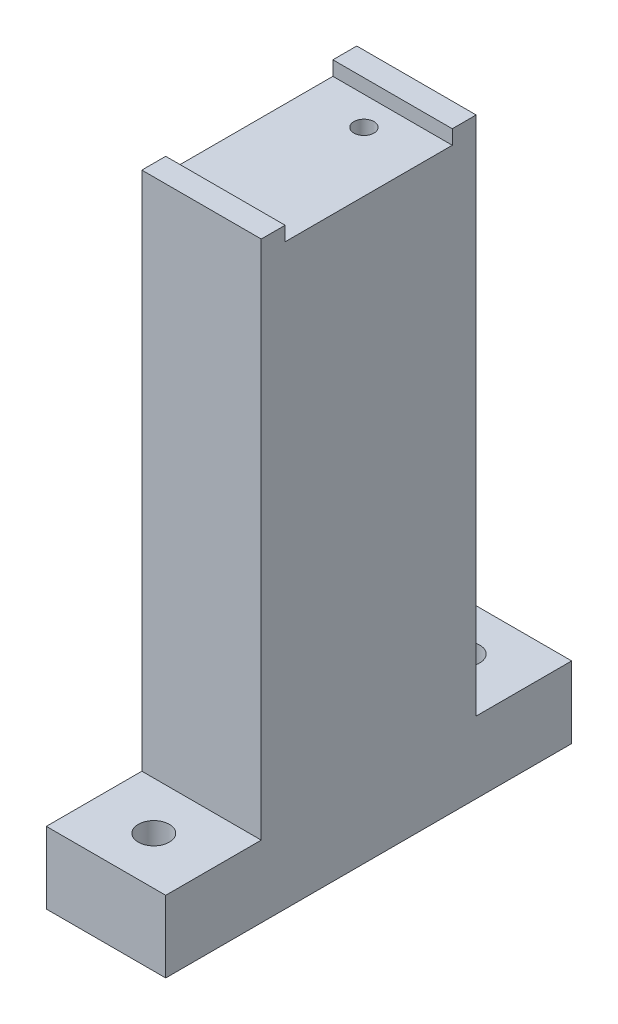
ISO-10303-21;
HEADER;
FILE_DESCRIPTION(('STEP AP214'),'2;1');
FILE_NAME('part.step','',(''),(''),'','','');
FILE_SCHEMA(('AUTOMOTIVE_DESIGN { 1 0 10303 214 1 1 1 1 }'));
ENDSEC;
DATA;
#1=APPLICATION_CONTEXT('core data for automotive mechanical design processes');
#2=APPLICATION_PROTOCOL_DEFINITION('international standard','automotive_design',2000,#1);
#3=PRODUCT_CONTEXT('',#1,'mechanical');
#4=PRODUCT('Part','Part','',(#3));
#5=PRODUCT_RELATED_PRODUCT_CATEGORY('part','',(#4));
#6=PRODUCT_DEFINITION_FORMATION('','',#4);
#7=PRODUCT_DEFINITION_CONTEXT('part definition',#1,'design');
#8=PRODUCT_DEFINITION('design','',#6,#7);
#9=PRODUCT_DEFINITION_SHAPE('','',#8);
#10=(LENGTH_UNIT() NAMED_UNIT(*) SI_UNIT(.MILLI.,.METRE.));
#11=(NAMED_UNIT(*) PLANE_ANGLE_UNIT() SI_UNIT($,.RADIAN.));
#12=(NAMED_UNIT(*) SI_UNIT($,.STERADIAN.) SOLID_ANGLE_UNIT());
#13=UNCERTAINTY_MEASURE_WITH_UNIT(LENGTH_MEASURE(1.E-05),#10,'distance_accuracy_value','');
#14=(GEOMETRIC_REPRESENTATION_CONTEXT(3) GLOBAL_UNCERTAINTY_ASSIGNED_CONTEXT((#13)) GLOBAL_UNIT_ASSIGNED_CONTEXT((#10,
#11,#12)) REPRESENTATION_CONTEXT('',''));
#15=CARTESIAN_POINT('',(0.,0.,0.));
#16=DIRECTION('',(0.,0.,1.));
#17=DIRECTION('',(1.,0.,0.));
#18=AXIS2_PLACEMENT_3D('',#15,#16,#17);
#19=CARTESIAN_POINT('',(25.,0.,85.));
#20=DIRECTION('',(-1.,0.,0.));
#21=DIRECTION('',(0.,0.,1.));
#22=AXIS2_PLACEMENT_3D('',#19,#20,#21);
#23=PLANE('',#22);
#24=DIRECTION('',(0.,1.,0.));
#25=VECTOR('',#24,1.);
#26=CARTESIAN_POINT('',(25.,121.,60.));
#27=LINE('',#26,#25);
#28=CARTESIAN_POINT('',(25.,121.,60.));
#29=VERTEX_POINT('',#28);
#30=CARTESIAN_POINT('',(25.,124.,60.));
#31=VERTEX_POINT('',#30);
#32=EDGE_CURVE('E134',#29,#31,#27,.T.);
#33=ORIENTED_EDGE('',*,*,#32,.T.);
#34=DIRECTION('',(0.,0.,-1.));
#35=VECTOR('',#34,1.);
#36=CARTESIAN_POINT('',(25.,124.,85.));
#37=LINE('',#36,#35);
#38=CARTESIAN_POINT('',(25.,124.,65.));
#39=VERTEX_POINT('',#38);
#40=EDGE_CURVE('E141',#39,#31,#37,.T.);
#41=ORIENTED_EDGE('',*,*,#40,.F.);
#42=DIRECTION('',(0.,-1.,0.));
#43=VECTOR('',#42,1.);
#44=CARTESIAN_POINT('',(25.,15.,65.));
#45=LINE('',#44,#43);
#46=CARTESIAN_POINT('',(25.,15.,65.));
#47=VERTEX_POINT('',#46);
#48=EDGE_CURVE('E123',#39,#47,#45,.T.);
#49=ORIENTED_EDGE('',*,*,#48,.T.);
#50=DIRECTION('',(0.,0.,1.));
#51=VECTOR('',#50,1.);
#52=CARTESIAN_POINT('',(25.,15.,85.));
#53=LINE('',#52,#51);
#54=CARTESIAN_POINT('',(25.,15.,85.));
#55=VERTEX_POINT('',#54);
#56=EDGE_CURVE('E133',#47,#55,#53,.T.);
#57=ORIENTED_EDGE('',*,*,#56,.T.);
#58=DIRECTION('',(0.,1.,0.));
#59=VECTOR('',#58,1.);
#60=CARTESIAN_POINT('',(25.,0.,85.));
#61=LINE('',#60,#59);
#62=CARTESIAN_POINT('',(25.,0.,85.));
#63=VERTEX_POINT('',#62);
#64=EDGE_CURVE('E214',#63,#55,#61,.T.);
#65=ORIENTED_EDGE('',*,*,#64,.F.);
#66=DIRECTION('',(0.,0.,-1.));
#67=VECTOR('',#66,1.);
#68=CARTESIAN_POINT('',(25.,0.,85.));
#69=LINE('',#68,#67);
#70=CARTESIAN_POINT('',(25.,0.,0.));
#71=VERTEX_POINT('',#70);
#72=EDGE_CURVE('E149',#63,#71,#69,.T.);
#73=ORIENTED_EDGE('',*,*,#72,.T.);
#74=DIRECTION('',(0.,1.,0.));
#75=VECTOR('',#74,1.);
#76=CARTESIAN_POINT('',(25.,0.,0.));
#77=LINE('',#76,#75);
#78=CARTESIAN_POINT('',(25.,14.9999999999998,0.));
#79=VERTEX_POINT('',#78);
#80=EDGE_CURVE('E223',#71,#79,#77,.T.);
#81=ORIENTED_EDGE('',*,*,#80,.T.);
#82=DIRECTION('',(0.,0.,1.));
#83=VECTOR('',#82,1.);
#84=CARTESIAN_POINT('',(25.,14.9999999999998,20.));
#85=LINE('',#84,#83);
#86=CARTESIAN_POINT('',(25.,14.9999999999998,20.));
#87=VERTEX_POINT('',#86);
#88=EDGE_CURVE('E185',#79,#87,#85,.T.);
#89=ORIENTED_EDGE('',*,*,#88,.T.);
#90=DIRECTION('',(0.,1.,0.));
#91=VECTOR('',#90,1.);
#92=CARTESIAN_POINT('',(25.,14.9999999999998,20.));
#93=LINE('',#92,#91);
#94=CARTESIAN_POINT('',(25.,124.,20.));
#95=VERTEX_POINT('',#94);
#96=EDGE_CURVE('E188',#87,#95,#93,.T.);
#97=ORIENTED_EDGE('',*,*,#96,.T.);
#98=CARTESIAN_POINT('',(25.,124.,25.));
#99=VERTEX_POINT('',#98);
#100=EDGE_CURVE('E150',#99,#95,#37,.T.);
#101=ORIENTED_EDGE('',*,*,#100,.F.);
#102=DIRECTION('',(0.,-1.,0.));
#103=VECTOR('',#102,1.);
#104=CARTESIAN_POINT('',(25.,121.,25.));
#105=LINE('',#104,#103);
#106=CARTESIAN_POINT('',(25.,121.,25.));
#107=VERTEX_POINT('',#106);
#108=EDGE_CURVE('E191',#99,#107,#105,.T.);
#109=ORIENTED_EDGE('',*,*,#108,.T.);
#110=DIRECTION('',(0.,0.,1.));
#111=VECTOR('',#110,1.);
#112=CARTESIAN_POINT('',(25.,121.,60.));
#113=LINE('',#112,#111);
#114=EDGE_CURVE('E194',#107,#29,#113,.T.);
#115=ORIENTED_EDGE('',*,*,#114,.T.);
#116=EDGE_LOOP('',(#33,#41,#49,#57,#65,#73,#81,#89,#97,#101,#109,#115));
#117=FACE_BOUND('',#116,.T.);
#118=ADVANCED_FACE('F33',(#117),#23,.F.);
#119=CARTESIAN_POINT('',(0.,124.,85.));
#120=DIRECTION('',(0.,-1.,0.));
#121=DIRECTION('',(0.,0.,-1.));
#122=AXIS2_PLACEMENT_3D('',#119,#120,#121);
#123=PLANE('',#122);
#124=DIRECTION('',(1.,0.,0.));
#125=VECTOR('',#124,1.);
#126=CARTESIAN_POINT('',(-60.,124.,60.));
#127=LINE('',#126,#125);
#128=CARTESIAN_POINT('',(0.,124.,60.));
#129=VERTEX_POINT('',#128);
#130=EDGE_CURVE('E144',#129,#31,#127,.T.);
#131=ORIENTED_EDGE('',*,*,#130,.F.);
#132=DIRECTION('',(0.,0.,-1.));
#133=VECTOR('',#132,1.);
#134=CARTESIAN_POINT('',(0.,124.,85.));
#135=LINE('',#134,#133);
#136=CARTESIAN_POINT('',(0.,124.,65.));
#137=VERTEX_POINT('',#136);
#138=EDGE_CURVE('E143',#137,#129,#135,.T.);
#139=ORIENTED_EDGE('',*,*,#138,.F.);
#140=DIRECTION('',(1.,0.,0.));
#141=VECTOR('',#140,1.);
#142=CARTESIAN_POINT('',(-60.,124.,65.));
#143=LINE('',#142,#141);
#144=EDGE_CURVE('E126',#137,#39,#143,.T.);
#145=ORIENTED_EDGE('',*,*,#144,.T.);
#146=ORIENTED_EDGE('',*,*,#40,.T.);
#147=EDGE_LOOP('',(#131,#139,#145,#146));
#148=FACE_BOUND('',#147,.T.);
#149=ADVANCED_FACE('F140',(#148),#123,.F.);
#150=DIRECTION('',(1.,0.,0.));
#151=VECTOR('',#150,1.);
#152=CARTESIAN_POINT('',(-60.,124.,25.));
#153=LINE('',#152,#151);
#154=CARTESIAN_POINT('',(0.,124.,25.));
#155=VERTEX_POINT('',#154);
#156=EDGE_CURVE('E50',#155,#99,#153,.T.);
#157=ORIENTED_EDGE('',*,*,#156,.T.);
#158=ORIENTED_EDGE('',*,*,#100,.T.);
#159=DIRECTION('',(1.,0.,0.));
#160=VECTOR('',#159,1.);
#161=CARTESIAN_POINT('',(-60.,124.,20.));
#162=LINE('',#161,#160);
#163=CARTESIAN_POINT('',(0.,124.,20.));
#164=VERTEX_POINT('',#163);
#165=EDGE_CURVE('E202',#164,#95,#162,.T.);
#166=ORIENTED_EDGE('',*,*,#165,.F.);
#167=EDGE_CURVE('E157',#155,#164,#135,.T.);
#168=ORIENTED_EDGE('',*,*,#167,.F.);
#169=EDGE_LOOP('',(#157,#158,#166,#168));
#170=FACE_BOUND('',#169,.T.);
#171=ADVANCED_FACE('F256',(#170),#123,.F.);
#172=CARTESIAN_POINT('',(0.,0.,85.));
#173=DIRECTION('',(1.,0.,0.));
#174=DIRECTION('',(0.,0.,-1.));
#175=AXIS2_PLACEMENT_3D('',#172,#173,#174);
#176=PLANE('',#175);
#177=DIRECTION('',(0.,1.,0.));
#178=VECTOR('',#177,1.);
#179=CARTESIAN_POINT('',(0.,0.,60.));
#180=LINE('',#179,#178);
#181=CARTESIAN_POINT('',(0.,121.,60.));
#182=VERTEX_POINT('',#181);
#183=EDGE_CURVE('E12',#182,#129,#180,.T.);
#184=ORIENTED_EDGE('',*,*,#183,.F.);
#185=DIRECTION('',(0.,0.,1.));
#186=VECTOR('',#185,1.);
#187=CARTESIAN_POINT('',(0.,121.,85.));
#188=LINE('',#187,#186);
#189=CARTESIAN_POINT('',(0.,121.,25.));
#190=VERTEX_POINT('',#189);
#191=EDGE_CURVE('E42',#190,#182,#188,.T.);
#192=ORIENTED_EDGE('',*,*,#191,.F.);
#193=DIRECTION('',(0.,-1.,0.));
#194=VECTOR('',#193,1.);
#195=CARTESIAN_POINT('',(0.,0.,25.));
#196=LINE('',#195,#194);
#197=EDGE_CURVE('E167',#155,#190,#196,.T.);
#198=ORIENTED_EDGE('',*,*,#197,.F.);
#199=ORIENTED_EDGE('',*,*,#167,.T.);
#200=DIRECTION('',(0.,1.,0.));
#201=VECTOR('',#200,1.);
#202=CARTESIAN_POINT('',(0.,0.,20.));
#203=LINE('',#202,#201);
#204=CARTESIAN_POINT('',(0.,14.9999999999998,20.));
#205=VERTEX_POINT('',#204);
#206=EDGE_CURVE('E165',#205,#164,#203,.T.);
#207=ORIENTED_EDGE('',*,*,#206,.F.);
#208=DIRECTION('',(0.,0.,1.));
#209=VECTOR('',#208,1.);
#210=CARTESIAN_POINT('',(0.,14.9999999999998,85.));
#211=LINE('',#210,#209);
#212=CARTESIAN_POINT('',(0.,14.9999999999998,0.));
#213=VERTEX_POINT('',#212);
#214=EDGE_CURVE('E198',#213,#205,#211,.T.);
#215=ORIENTED_EDGE('',*,*,#214,.F.);
#216=DIRECTION('',(0.,-1.,0.));
#217=VECTOR('',#216,1.);
#218=CARTESIAN_POINT('',(0.,0.,0.));
#219=LINE('',#218,#217);
#220=CARTESIAN_POINT('',(0.,0.,0.));
#221=VERTEX_POINT('',#220);
#222=EDGE_CURVE('E215',#213,#221,#219,.T.);
#223=ORIENTED_EDGE('',*,*,#222,.T.);
#224=DIRECTION('',(0.,0.,-1.));
#225=VECTOR('',#224,1.);
#226=CARTESIAN_POINT('',(0.,0.,85.));
#227=LINE('',#226,#225);
#228=CARTESIAN_POINT('',(0.,0.,85.));
#229=VERTEX_POINT('',#228);
#230=EDGE_CURVE('E220',#229,#221,#227,.T.);
#231=ORIENTED_EDGE('',*,*,#230,.F.);
#232=DIRECTION('',(0.,-1.,0.));
#233=VECTOR('',#232,1.);
#234=CARTESIAN_POINT('',(0.,0.,85.));
#235=LINE('',#234,#233);
#236=CARTESIAN_POINT('',(0.,15.,85.));
#237=VERTEX_POINT('',#236);
#238=EDGE_CURVE('E218',#237,#229,#235,.T.);
#239=ORIENTED_EDGE('',*,*,#238,.F.);
#240=DIRECTION('',(0.,0.,1.));
#241=VECTOR('',#240,1.);
#242=CARTESIAN_POINT('',(0.,15.,85.));
#243=LINE('',#242,#241);
#244=CARTESIAN_POINT('',(0.,15.,65.));
#245=VERTEX_POINT('',#244);
#246=EDGE_CURVE('E58',#245,#237,#243,.T.);
#247=ORIENTED_EDGE('',*,*,#246,.F.);
#248=DIRECTION('',(0.,-1.,0.));
#249=VECTOR('',#248,1.);
#250=CARTESIAN_POINT('',(0.,0.,65.));
#251=LINE('',#250,#249);
#252=EDGE_CURVE('E163',#137,#245,#251,.T.);
#253=ORIENTED_EDGE('',*,*,#252,.F.);
#254=ORIENTED_EDGE('',*,*,#138,.T.);
#255=EDGE_LOOP('',(#184,#192,#198,#199,#207,#215,#223,#231,#239,#247,#253,#254));
#256=FACE_BOUND('',#255,.T.);
#257=ADVANCED_FACE('F236',(#256),#176,.F.);
#258=CARTESIAN_POINT('',(25.,0.,85.));
#259=DIRECTION('',(0.,0.,1.));
#260=DIRECTION('',(1.,0.,0.));
#261=AXIS2_PLACEMENT_3D('',#258,#259,#260);
#262=PLANE('',#261);
#263=ORIENTED_EDGE('',*,*,#64,.T.);
#264=DIRECTION('',(-1.,0.,0.));
#265=VECTOR('',#264,1.);
#266=CARTESIAN_POINT('',(25.,15.,85.));
#267=LINE('',#266,#265);
#268=EDGE_CURVE('E161',#55,#237,#267,.T.);
#269=ORIENTED_EDGE('',*,*,#268,.T.);
#270=ORIENTED_EDGE('',*,*,#238,.T.);
#271=DIRECTION('',(1.,0.,0.));
#272=VECTOR('',#271,1.);
#273=CARTESIAN_POINT('',(0.,0.,85.));
#274=LINE('',#273,#272);
#275=EDGE_CURVE('E211',#229,#63,#274,.T.);
#276=ORIENTED_EDGE('',*,*,#275,.T.);
#277=EDGE_LOOP('',(#263,#269,#270,#276));
#278=FACE_BOUND('',#277,.T.);
#279=ADVANCED_FACE('F241',(#278),#262,.T.);
#280=CARTESIAN_POINT('',(25.,0.,0.));
#281=DIRECTION('',(0.,0.,1.));
#282=DIRECTION('',(1.,0.,0.));
#283=AXIS2_PLACEMENT_3D('',#280,#281,#282);
#284=PLANE('',#283);
#285=DIRECTION('',(-1.,0.,0.));
#286=VECTOR('',#285,1.);
#287=CARTESIAN_POINT('',(25.,14.9999999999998,0.));
#288=LINE('',#287,#286);
#289=EDGE_CURVE('E153',#79,#213,#288,.T.);
#290=ORIENTED_EDGE('',*,*,#289,.F.);
#291=ORIENTED_EDGE('',*,*,#80,.F.);
#292=DIRECTION('',(1.,0.,0.));
#293=VECTOR('',#292,1.);
#294=CARTESIAN_POINT('',(0.,0.,0.));
#295=LINE('',#294,#293);
#296=EDGE_CURVE('E210',#221,#71,#295,.T.);
#297=ORIENTED_EDGE('',*,*,#296,.F.);
#298=ORIENTED_EDGE('',*,*,#222,.F.);
#299=EDGE_LOOP('',(#290,#291,#297,#298));
#300=FACE_BOUND('',#299,.T.);
#301=ADVANCED_FACE('F245',(#300),#284,.F.);
#302=CARTESIAN_POINT('',(0.,0.,85.));
#303=DIRECTION('',(0.,1.,0.));
#304=DIRECTION('',(0.,0.,1.));
#305=AXIS2_PLACEMENT_3D('',#302,#303,#304);
#306=PLANE('',#305);
#307=CARTESIAN_POINT('',(12.5,0.,75.));
#308=DIRECTION('',(0.,1.,0.));
#309=DIRECTION('',(0.,0.,1.));
#310=AXIS2_PLACEMENT_3D('',#307,#308,#309);
#311=CIRCLE('',#310,3.25);
#312=CARTESIAN_POINT('',(12.5,0.,78.25));
#313=VERTEX_POINT('',#312);
#314=EDGE_CURVE('E180',#313,#313,#311,.T.);
#315=ORIENTED_EDGE('',*,*,#314,.T.);
#316=EDGE_LOOP('',(#315));
#317=FACE_BOUND('',#316,.T.);
#318=CARTESIAN_POINT('',(12.5,0.,10.));
#319=DIRECTION('',(0.,1.,0.));
#320=DIRECTION('',(0.,0.,1.));
#321=AXIS2_PLACEMENT_3D('',#318,#319,#320);
#322=CIRCLE('',#321,3.25);
#323=CARTESIAN_POINT('',(12.5,0.,13.25));
#324=VERTEX_POINT('',#323);
#325=EDGE_CURVE('E171',#324,#324,#322,.T.);
#326=ORIENTED_EDGE('',*,*,#325,.T.);
#327=EDGE_LOOP('',(#326));
#328=FACE_BOUND('',#327,.T.);
#329=ORIENTED_EDGE('',*,*,#296,.T.);
#330=ORIENTED_EDGE('',*,*,#72,.F.);
#331=ORIENTED_EDGE('',*,*,#275,.F.);
#332=ORIENTED_EDGE('',*,*,#230,.T.);
#333=EDGE_LOOP('',(#329,#330,#331,#332));
#334=FACE_BOUND('',#333,.T.);
#335=ADVANCED_FACE('F35',(#317,#328,#334),#306,.F.);
#336=CARTESIAN_POINT('',(-60.,14.9999999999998,20.));
#337=DIRECTION('',(0.,1.,0.));
#338=DIRECTION('',(0.,0.,1.));
#339=AXIS2_PLACEMENT_3D('',#336,#337,#338);
#340=PLANE('',#339);
#341=CARTESIAN_POINT('',(12.5,14.9999999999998,10.));
#342=DIRECTION('',(0.,1.,0.));
#343=DIRECTION('',(0.,0.,1.));
#344=AXIS2_PLACEMENT_3D('',#341,#342,#343);
#345=CIRCLE('',#344,3.25);
#346=CARTESIAN_POINT('',(12.5,14.9999999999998,13.25));
#347=VERTEX_POINT('',#346);
#348=EDGE_CURVE('E169',#347,#347,#345,.T.);
#349=ORIENTED_EDGE('',*,*,#348,.F.);
#350=EDGE_LOOP('',(#349));
#351=FACE_BOUND('',#350,.T.);
#352=ORIENTED_EDGE('',*,*,#214,.T.);
#353=DIRECTION('',(1.,0.,0.));
#354=VECTOR('',#353,1.);
#355=CARTESIAN_POINT('',(-60.,14.9999999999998,20.));
#356=LINE('',#355,#354);
#357=EDGE_CURVE('E204',#205,#87,#356,.T.);
#358=ORIENTED_EDGE('',*,*,#357,.T.);
#359=ORIENTED_EDGE('',*,*,#88,.F.);
#360=ORIENTED_EDGE('',*,*,#289,.T.);
#361=EDGE_LOOP('',(#352,#358,#359,#360));
#362=FACE_BOUND('',#361,.T.);
#363=ADVANCED_FACE('F249',(#351,#362),#340,.T.);
#364=CARTESIAN_POINT('',(-60.,14.9999999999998,20.));
#365=DIRECTION('',(0.,0.,-1.));
#366=DIRECTION('',(-1.,0.,0.));
#367=AXIS2_PLACEMENT_3D('',#364,#365,#366);
#368=PLANE('',#367);
#369=ORIENTED_EDGE('',*,*,#206,.T.);
#370=ORIENTED_EDGE('',*,*,#165,.T.);
#371=ORIENTED_EDGE('',*,*,#96,.F.);
#372=ORIENTED_EDGE('',*,*,#357,.F.);
#373=EDGE_LOOP('',(#369,#370,#371,#372));
#374=FACE_BOUND('',#373,.T.);
#375=ADVANCED_FACE('F253',(#374),#368,.T.);
#376=CARTESIAN_POINT('',(-60.,15.,85.));
#377=DIRECTION('',(0.,1.,0.));
#378=DIRECTION('',(0.,0.,1.));
#379=AXIS2_PLACEMENT_3D('',#376,#377,#378);
#380=PLANE('',#379);
#381=CARTESIAN_POINT('',(12.5,15.,75.));
#382=DIRECTION('',(0.,1.,0.));
#383=DIRECTION('',(0.,0.,1.));
#384=AXIS2_PLACEMENT_3D('',#381,#382,#383);
#385=CIRCLE('',#384,3.25);
#386=CARTESIAN_POINT('',(12.5,15.,78.25));
#387=VERTEX_POINT('',#386);
#388=EDGE_CURVE('E37',#387,#387,#385,.T.);
#389=ORIENTED_EDGE('',*,*,#388,.F.);
#390=EDGE_LOOP('',(#389));
#391=FACE_BOUND('',#390,.T.);
#392=ORIENTED_EDGE('',*,*,#246,.T.);
#393=ORIENTED_EDGE('',*,*,#268,.F.);
#394=ORIENTED_EDGE('',*,*,#56,.F.);
#395=DIRECTION('',(1.,0.,0.));
#396=VECTOR('',#395,1.);
#397=CARTESIAN_POINT('',(-60.,15.,65.));
#398=LINE('',#397,#396);
#399=EDGE_CURVE('E128',#245,#47,#398,.T.);
#400=ORIENTED_EDGE('',*,*,#399,.F.);
#401=EDGE_LOOP('',(#392,#393,#394,#400));
#402=FACE_BOUND('',#401,.T.);
#403=ADVANCED_FACE('F239',(#391,#402),#380,.T.);
#404=CARTESIAN_POINT('',(-60.,15.,65.));
#405=DIRECTION('',(0.,0.,1.));
#406=DIRECTION('',(1.,0.,0.));
#407=AXIS2_PLACEMENT_3D('',#404,#405,#406);
#408=PLANE('',#407);
#409=ORIENTED_EDGE('',*,*,#252,.T.);
#410=ORIENTED_EDGE('',*,*,#399,.T.);
#411=ORIENTED_EDGE('',*,*,#48,.F.);
#412=ORIENTED_EDGE('',*,*,#144,.F.);
#413=EDGE_LOOP('',(#409,#410,#411,#412));
#414=FACE_BOUND('',#413,.T.);
#415=ADVANCED_FACE('F125',(#414),#408,.T.);
#416=CARTESIAN_POINT('',(-60.,121.,60.));
#417=DIRECTION('',(0.,0.,-1.));
#418=DIRECTION('',(-1.,0.,0.));
#419=AXIS2_PLACEMENT_3D('',#416,#417,#418);
#420=PLANE('',#419);
#421=ORIENTED_EDGE('',*,*,#183,.T.);
#422=ORIENTED_EDGE('',*,*,#130,.T.);
#423=ORIENTED_EDGE('',*,*,#32,.F.);
#424=DIRECTION('',(1.,0.,0.));
#425=VECTOR('',#424,1.);
#426=CARTESIAN_POINT('',(-60.,121.,60.));
#427=LINE('',#426,#425);
#428=EDGE_CURVE('E196',#182,#29,#427,.T.);
#429=ORIENTED_EDGE('',*,*,#428,.F.);
#430=EDGE_LOOP('',(#421,#422,#423,#429));
#431=FACE_BOUND('',#430,.T.);
#432=ADVANCED_FACE('F265',(#431),#420,.T.);
#433=CARTESIAN_POINT('',(-60.,121.,60.));
#434=DIRECTION('',(0.,1.,0.));
#435=DIRECTION('',(0.,0.,1.));
#436=AXIS2_PLACEMENT_3D('',#433,#434,#435);
#437=PLANE('',#436);
#438=CARTESIAN_POINT('',(12.5,121.,31.));
#439=DIRECTION('',(0.,1.,0.));
#440=DIRECTION('',(0.,0.,1.));
#441=AXIS2_PLACEMENT_3D('',#438,#439,#440);
#442=CIRCLE('',#441,2.09999999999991);
#443=CARTESIAN_POINT('',(12.5,121.,33.0999999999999));
#444=VERTEX_POINT('',#443);
#445=EDGE_CURVE('E386',#444,#444,#442,.T.);
#446=ORIENTED_EDGE('',*,*,#445,.F.);
#447=EDGE_LOOP('',(#446));
#448=FACE_BOUND('',#447,.T.);
#449=ORIENTED_EDGE('',*,*,#191,.T.);
#450=ORIENTED_EDGE('',*,*,#428,.T.);
#451=ORIENTED_EDGE('',*,*,#114,.F.);
#452=DIRECTION('',(1.,0.,0.));
#453=VECTOR('',#452,1.);
#454=CARTESIAN_POINT('',(-60.,121.,25.));
#455=LINE('',#454,#453);
#456=EDGE_CURVE('E199',#190,#107,#455,.T.);
#457=ORIENTED_EDGE('',*,*,#456,.F.);
#458=EDGE_LOOP('',(#449,#450,#451,#457));
#459=FACE_BOUND('',#458,.T.);
#460=ADVANCED_FACE('F262',(#448,#459),#437,.T.);
#461=CARTESIAN_POINT('',(-60.,121.,25.));
#462=DIRECTION('',(0.,0.,1.));
#463=DIRECTION('',(1.,0.,0.));
#464=AXIS2_PLACEMENT_3D('',#461,#462,#463);
#465=PLANE('',#464);
#466=ORIENTED_EDGE('',*,*,#197,.T.);
#467=ORIENTED_EDGE('',*,*,#456,.T.);
#468=ORIENTED_EDGE('',*,*,#108,.F.);
#469=ORIENTED_EDGE('',*,*,#156,.F.);
#470=EDGE_LOOP('',(#466,#467,#468,#469));
#471=FACE_BOUND('',#470,.T.);
#472=ADVANCED_FACE('F259',(#471),#465,.T.);
#473=CARTESIAN_POINT('',(12.5,0.,10.));
#474=DIRECTION('',(0.,1.,0.));
#475=DIRECTION('',(0.,0.,1.));
#476=AXIS2_PLACEMENT_3D('',#473,#474,#475);
#477=CYLINDRICAL_SURFACE('',#476,3.25);
#478=ORIENTED_EDGE('',*,*,#348,.T.);
#479=EDGE_LOOP('',(#478));
#480=FACE_BOUND('',#479,.T.);
#481=ORIENTED_EDGE('',*,*,#325,.F.);
#482=EDGE_LOOP('',(#481));
#483=FACE_BOUND('',#482,.T.);
#484=ADVANCED_FACE('F339',(#480,#483),#477,.F.);
#485=CARTESIAN_POINT('',(12.5,0.,75.));
#486=DIRECTION('',(0.,1.,0.));
#487=DIRECTION('',(0.,0.,1.));
#488=AXIS2_PLACEMENT_3D('',#485,#486,#487);
#489=CYLINDRICAL_SURFACE('',#488,3.25);
#490=ORIENTED_EDGE('',*,*,#388,.T.);
#491=EDGE_LOOP('',(#490));
#492=FACE_BOUND('',#491,.T.);
#493=ORIENTED_EDGE('',*,*,#314,.F.);
#494=EDGE_LOOP('',(#493));
#495=FACE_BOUND('',#494,.T.);
#496=ADVANCED_FACE('F350',(#492,#495),#489,.F.);
#497=CARTESIAN_POINT('',(12.5,106.,31.));
#498=DIRECTION('',(0.,1.,0.));
#499=DIRECTION('',(0.,0.,1.));
#500=AXIS2_PLACEMENT_3D('',#497,#498,#499);
#501=CYLINDRICAL_SURFACE('',#500,2.09999999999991);
#502=CARTESIAN_POINT('',(12.5,106.,31.));
#503=DIRECTION('',(0.,1.,0.));
#504=DIRECTION('',(0.,0.,1.));
#505=AXIS2_PLACEMENT_3D('',#502,#503,#504);
#506=CIRCLE('',#505,2.09999999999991);
#507=CARTESIAN_POINT('',(12.5,106.,33.0999999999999));
#508=VERTEX_POINT('',#507);
#509=EDGE_CURVE('E385',#508,#508,#506,.T.);
#510=ORIENTED_EDGE('',*,*,#509,.F.);
#511=EDGE_LOOP('',(#510));
#512=FACE_BOUND('',#511,.T.);
#513=ORIENTED_EDGE('',*,*,#445,.T.);
#514=EDGE_LOOP('',(#513));
#515=FACE_BOUND('',#514,.T.);
#516=ADVANCED_FACE('F356',(#512,#515),#501,.F.);
#517=CARTESIAN_POINT('',(12.5,106.,31.));
#518=DIRECTION('',(0.,1.,0.));
#519=DIRECTION('',(0.,0.,1.));
#520=AXIS2_PLACEMENT_3D('',#517,#518,#519);
#521=PLANE('',#520);
#522=ORIENTED_EDGE('',*,*,#509,.T.);
#523=EDGE_LOOP('',(#522));
#524=FACE_BOUND('',#523,.T.);
#525=ADVANCED_FACE('F364',(#524),#521,.T.);
#526=CLOSED_SHELL('',(#118,#149,#171,#257,#279,#301,#335,#363,#375,#403,#415,#432,#460,#472,
#484,#496,#516,#525));
#527=MANIFOLD_SOLID_BREP('B2',#526);
#528=ADVANCED_BREP_SHAPE_REPRESENTATION('',(#18,#527),#14);
#529=SHAPE_DEFINITION_REPRESENTATION(#9,#528);
ENDSEC;
END-ISO-10303-21;
